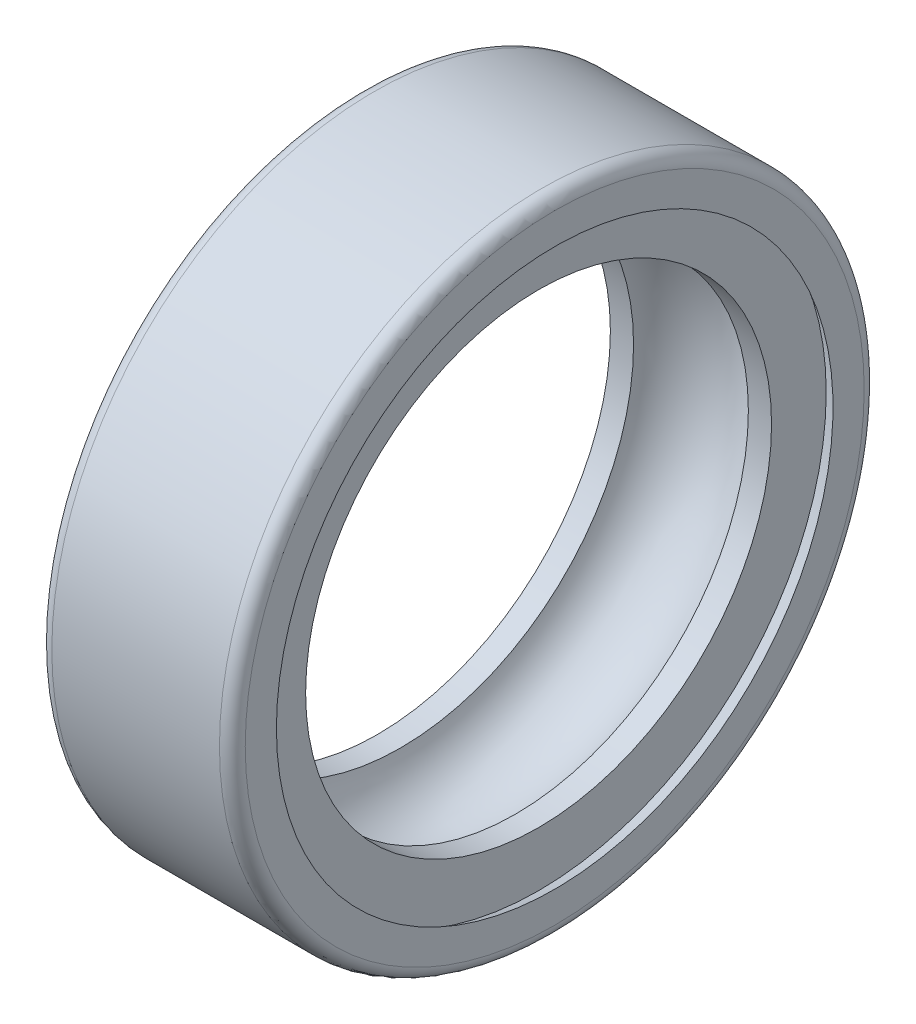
ISO-10303-21;
HEADER;
FILE_DESCRIPTION(('STEP AP214'),'2;1');
FILE_NAME('part.step','',(''),(''),'','','');
FILE_SCHEMA(('AUTOMOTIVE_DESIGN { 1 0 10303 214 1 1 1 1 }'));
ENDSEC;
DATA;
#1=APPLICATION_CONTEXT('core data for automotive mechanical design processes');
#2=APPLICATION_PROTOCOL_DEFINITION('international standard','automotive_design',2000,#1);
#3=PRODUCT_CONTEXT('',#1,'mechanical');
#4=PRODUCT('Part','Part','',(#3));
#5=PRODUCT_RELATED_PRODUCT_CATEGORY('part','',(#4));
#6=PRODUCT_DEFINITION_FORMATION('','',#4);
#7=PRODUCT_DEFINITION_CONTEXT('part definition',#1,'design');
#8=PRODUCT_DEFINITION('design','',#6,#7);
#9=PRODUCT_DEFINITION_SHAPE('','',#8);
#10=(LENGTH_UNIT() NAMED_UNIT(*) SI_UNIT(.MILLI.,.METRE.));
#11=(NAMED_UNIT(*) PLANE_ANGLE_UNIT() SI_UNIT($,.RADIAN.));
#12=(NAMED_UNIT(*) SI_UNIT($,.STERADIAN.) SOLID_ANGLE_UNIT());
#13=UNCERTAINTY_MEASURE_WITH_UNIT(LENGTH_MEASURE(1.E-05),#10,'distance_accuracy_value','');
#14=(GEOMETRIC_REPRESENTATION_CONTEXT(3) GLOBAL_UNCERTAINTY_ASSIGNED_CONTEXT((#13)) GLOBAL_UNIT_ASSIGNED_CONTEXT((#10,
#11,#12)) REPRESENTATION_CONTEXT('',''));
#15=CARTESIAN_POINT('',(0.,0.,0.));
#16=DIRECTION('',(0.,0.,1.));
#17=DIRECTION('',(1.,0.,0.));
#18=AXIS2_PLACEMENT_3D('',#15,#16,#17);
#19=CARTESIAN_POINT('',(0.,0.,0.));
#20=DIRECTION('',(-1.,0.,0.));
#21=DIRECTION('',(0.,0.,1.));
#22=AXIS2_PLACEMENT_3D('',#19,#20,#21);
#23=CYLINDRICAL_SURFACE('',#22,10.84);
#24=CARTESIAN_POINT('',(8.25,0.,0.));
#25=DIRECTION('',(-1.,0.,0.));
#26=DIRECTION('',(0.,0.,1.));
#27=AXIS2_PLACEMENT_3D('',#24,#25,#26);
#28=CIRCLE('',#27,10.84);
#29=CARTESIAN_POINT('',(8.25,0.,10.84));
#30=VERTEX_POINT('',#29);
#31=EDGE_CURVE('E10',#30,#30,#28,.T.);
#32=ORIENTED_EDGE('',*,*,#31,.F.);
#33=EDGE_LOOP('',(#32));
#34=FACE_BOUND('',#33,.T.);
#35=CARTESIAN_POINT('',(7.17102976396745,0.,0.));
#36=DIRECTION('',(-1.,0.,0.));
#37=DIRECTION('',(0.,0.,1.));
#38=AXIS2_PLACEMENT_3D('',#35,#36,#37);
#39=CIRCLE('',#38,10.84);
#40=CARTESIAN_POINT('',(7.17102976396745,0.,10.84));
#41=VERTEX_POINT('',#40);
#42=EDGE_CURVE('E72',#41,#41,#39,.T.);
#43=ORIENTED_EDGE('',*,*,#42,.T.);
#44=EDGE_LOOP('',(#43));
#45=FACE_BOUND('',#44,.T.);
#46=ADVANCED_FACE('F14',(#34,#45),#23,.F.);
#47=CARTESIAN_POINT('',(8.25,10.84,0.));
#48=DIRECTION('',(-1.,0.,0.));
#49=DIRECTION('',(0.,0.,1.));
#50=AXIS2_PLACEMENT_3D('',#47,#48,#49);
#51=PLANE('',#50);
#52=CARTESIAN_POINT('',(8.25,0.,0.));
#53=DIRECTION('',(-1.,0.,0.));
#54=DIRECTION('',(0.,0.,1.));
#55=AXIS2_PLACEMENT_3D('',#52,#53,#54);
#56=CIRCLE('',#55,13.3830127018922);
#57=CARTESIAN_POINT('',(8.25,0.,13.3830127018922));
#58=VERTEX_POINT('',#57);
#59=EDGE_CURVE('E21',#58,#58,#56,.T.);
#60=ORIENTED_EDGE('',*,*,#59,.F.);
#61=EDGE_LOOP('',(#60));
#62=FACE_BOUND('',#61,.T.);
#63=ORIENTED_EDGE('',*,*,#31,.T.);
#64=EDGE_LOOP('',(#63));
#65=FACE_BOUND('',#64,.T.);
#66=ADVANCED_FACE('F91',(#62,#65),#51,.F.);
#67=CARTESIAN_POINT('',(8.25,0.,0.));
#68=DIRECTION('',(-1.,0.,0.));
#69=DIRECTION('',(0.,0.,1.));
#70=AXIS2_PLACEMENT_3D('',#67,#68,#69);
#71=CONICAL_SURFACE('',#70,13.3830127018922,0.523598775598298);
#72=CARTESIAN_POINT('',(9.,0.,0.));
#73=DIRECTION('',(-1.,0.,0.));
#74=DIRECTION('',(0.,0.,1.));
#75=AXIS2_PLACEMENT_3D('',#72,#73,#74);
#76=CIRCLE('',#75,12.95);
#77=CARTESIAN_POINT('',(9.,0.,12.95));
#78=VERTEX_POINT('',#77);
#79=EDGE_CURVE('E30',#78,#78,#76,.T.);
#80=ORIENTED_EDGE('',*,*,#79,.F.);
#81=EDGE_LOOP('',(#80));
#82=FACE_BOUND('',#81,.T.);
#83=ORIENTED_EDGE('',*,*,#59,.T.);
#84=EDGE_LOOP('',(#83));
#85=FACE_BOUND('',#84,.T.);
#86=ADVANCED_FACE('F96',(#82,#85),#71,.F.);
#87=CARTESIAN_POINT('',(9.,12.95,0.));
#88=DIRECTION('',(-1.,0.,0.));
#89=DIRECTION('',(0.,0.,1.));
#90=AXIS2_PLACEMENT_3D('',#87,#88,#89);
#91=PLANE('',#90);
#92=CARTESIAN_POINT('',(9.,0.,0.));
#93=DIRECTION('',(-1.,0.,0.));
#94=DIRECTION('',(0.,0.,1.));
#95=AXIS2_PLACEMENT_3D('',#92,#93,#94);
#96=CIRCLE('',#95,14.4);
#97=CARTESIAN_POINT('',(9.,0.,14.4));
#98=VERTEX_POINT('',#97);
#99=EDGE_CURVE('E38',#98,#98,#96,.T.);
#100=ORIENTED_EDGE('',*,*,#99,.F.);
#101=EDGE_LOOP('',(#100));
#102=FACE_BOUND('',#101,.T.);
#103=ORIENTED_EDGE('',*,*,#79,.T.);
#104=EDGE_LOOP('',(#103));
#105=FACE_BOUND('',#104,.T.);
#106=ADVANCED_FACE('F101',(#102,#105),#91,.F.);
#107=CARTESIAN_POINT('',(8.4,0.,0.));
#108=DIRECTION('',(-1.,0.,0.));
#109=DIRECTION('',(0.,0.,1.));
#110=AXIS2_PLACEMENT_3D('',#107,#108,#109);
#111=TOROIDAL_SURFACE('',#110,14.4,0.6);
#112=CARTESIAN_POINT('',(8.4,0.,0.));
#113=DIRECTION('',(-1.,0.,0.));
#114=DIRECTION('',(0.,0.,1.));
#115=AXIS2_PLACEMENT_3D('',#112,#113,#114);
#116=CIRCLE('',#115,15.);
#117=CARTESIAN_POINT('',(8.4,0.,15.));
#118=VERTEX_POINT('',#117);
#119=EDGE_CURVE('E44',#118,#118,#116,.T.);
#120=ORIENTED_EDGE('',*,*,#119,.F.);
#121=EDGE_LOOP('',(#120));
#122=FACE_BOUND('',#121,.T.);
#123=ORIENTED_EDGE('',*,*,#99,.T.);
#124=EDGE_LOOP('',(#123));
#125=FACE_BOUND('',#124,.T.);
#126=ADVANCED_FACE('F107',(#122,#125),#111,.T.);
#127=CARTESIAN_POINT('',(0.,0.,0.));
#128=DIRECTION('',(-1.,0.,0.));
#129=DIRECTION('',(0.,0.,1.));
#130=AXIS2_PLACEMENT_3D('',#127,#128,#129);
#131=CYLINDRICAL_SURFACE('',#130,15.);
#132=CARTESIAN_POINT('',(0.6,0.,0.));
#133=DIRECTION('',(-1.,0.,0.));
#134=DIRECTION('',(0.,0.,1.));
#135=AXIS2_PLACEMENT_3D('',#132,#133,#134);
#136=CIRCLE('',#135,15.);
#137=CARTESIAN_POINT('',(0.6,0.,15.));
#138=VERTEX_POINT('',#137);
#139=EDGE_CURVE('E48',#138,#138,#136,.T.);
#140=ORIENTED_EDGE('',*,*,#139,.F.);
#141=EDGE_LOOP('',(#140));
#142=FACE_BOUND('',#141,.T.);
#143=ORIENTED_EDGE('',*,*,#119,.T.);
#144=EDGE_LOOP('',(#143));
#145=FACE_BOUND('',#144,.T.);
#146=ADVANCED_FACE('F111',(#142,#145),#131,.T.);
#147=CARTESIAN_POINT('',(0.6,0.,0.));
#148=DIRECTION('',(-1.,0.,0.));
#149=DIRECTION('',(0.,0.,1.));
#150=AXIS2_PLACEMENT_3D('',#147,#148,#149);
#151=TOROIDAL_SURFACE('',#150,14.4,0.6);
#152=CARTESIAN_POINT('',(0.,0.,0.));
#153=DIRECTION('',(-1.,0.,0.));
#154=DIRECTION('',(0.,0.,1.));
#155=AXIS2_PLACEMENT_3D('',#152,#153,#154);
#156=CIRCLE('',#155,14.4);
#157=CARTESIAN_POINT('',(0.,0.,14.4));
#158=VERTEX_POINT('',#157);
#159=EDGE_CURVE('E52',#158,#158,#156,.T.);
#160=ORIENTED_EDGE('',*,*,#159,.F.);
#161=EDGE_LOOP('',(#160));
#162=FACE_BOUND('',#161,.T.);
#163=ORIENTED_EDGE('',*,*,#139,.T.);
#164=EDGE_LOOP('',(#163));
#165=FACE_BOUND('',#164,.T.);
#166=ADVANCED_FACE('F115',(#162,#165),#151,.T.);
#167=CARTESIAN_POINT('',(0.,14.4,0.));
#168=DIRECTION('',(1.,0.,0.));
#169=DIRECTION('',(0.,0.,-1.));
#170=AXIS2_PLACEMENT_3D('',#167,#168,#169);
#171=PLANE('',#170);
#172=CARTESIAN_POINT('',(0.,0.,0.));
#173=DIRECTION('',(-1.,0.,0.));
#174=DIRECTION('',(0.,0.,1.));
#175=AXIS2_PLACEMENT_3D('',#172,#173,#174);
#176=CIRCLE('',#175,12.95);
#177=CARTESIAN_POINT('',(0.,0.,12.95));
#178=VERTEX_POINT('',#177);
#179=EDGE_CURVE('E56',#178,#178,#176,.T.);
#180=ORIENTED_EDGE('',*,*,#179,.F.);
#181=EDGE_LOOP('',(#180));
#182=FACE_BOUND('',#181,.T.);
#183=ORIENTED_EDGE('',*,*,#159,.T.);
#184=EDGE_LOOP('',(#183));
#185=FACE_BOUND('',#184,.T.);
#186=ADVANCED_FACE('F119',(#182,#185),#171,.F.);
#187=CARTESIAN_POINT('',(0.,0.,0.));
#188=DIRECTION('',(1.,0.,0.));
#189=DIRECTION('',(0.,0.,-1.));
#190=AXIS2_PLACEMENT_3D('',#187,#188,#189);
#191=CONICAL_SURFACE('',#190,12.95,0.523598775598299);
#192=CARTESIAN_POINT('',(0.75,0.,0.));
#193=DIRECTION('',(-1.,0.,0.));
#194=DIRECTION('',(0.,0.,1.));
#195=AXIS2_PLACEMENT_3D('',#192,#193,#194);
#196=CIRCLE('',#195,13.3830127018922);
#197=CARTESIAN_POINT('',(0.75,0.,13.3830127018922));
#198=VERTEX_POINT('',#197);
#199=EDGE_CURVE('E60',#198,#198,#196,.T.);
#200=ORIENTED_EDGE('',*,*,#199,.F.);
#201=EDGE_LOOP('',(#200));
#202=FACE_BOUND('',#201,.T.);
#203=ORIENTED_EDGE('',*,*,#179,.T.);
#204=EDGE_LOOP('',(#203));
#205=FACE_BOUND('',#204,.T.);
#206=ADVANCED_FACE('F123',(#202,#205),#191,.F.);
#207=CARTESIAN_POINT('',(0.75,13.3830127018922,0.));
#208=DIRECTION('',(1.,0.,0.));
#209=DIRECTION('',(0.,0.,-1.));
#210=AXIS2_PLACEMENT_3D('',#207,#208,#209);
#211=PLANE('',#210);
#212=CARTESIAN_POINT('',(0.75,0.,0.));
#213=DIRECTION('',(-1.,0.,0.));
#214=DIRECTION('',(0.,0.,1.));
#215=AXIS2_PLACEMENT_3D('',#212,#213,#214);
#216=CIRCLE('',#215,10.84);
#217=CARTESIAN_POINT('',(0.75,0.,10.84));
#218=VERTEX_POINT('',#217);
#219=EDGE_CURVE('E64',#218,#218,#216,.T.);
#220=ORIENTED_EDGE('',*,*,#219,.F.);
#221=EDGE_LOOP('',(#220));
#222=FACE_BOUND('',#221,.T.);
#223=ORIENTED_EDGE('',*,*,#199,.T.);
#224=EDGE_LOOP('',(#223));
#225=FACE_BOUND('',#224,.T.);
#226=ADVANCED_FACE('F87',(#222,#225),#211,.F.);
#227=CARTESIAN_POINT('',(0.,0.,0.));
#228=DIRECTION('',(-1.,0.,0.));
#229=DIRECTION('',(0.,0.,1.));
#230=AXIS2_PLACEMENT_3D('',#227,#228,#229);
#231=CYLINDRICAL_SURFACE('',#230,10.84);
#232=CARTESIAN_POINT('',(1.82897023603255,0.,0.));
#233=DIRECTION('',(-1.,0.,0.));
#234=DIRECTION('',(0.,0.,1.));
#235=AXIS2_PLACEMENT_3D('',#232,#233,#234);
#236=CIRCLE('',#235,10.84);
#237=CARTESIAN_POINT('',(1.82897023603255,0.,10.84));
#238=VERTEX_POINT('',#237);
#239=EDGE_CURVE('E68',#238,#238,#236,.T.);
#240=ORIENTED_EDGE('',*,*,#239,.F.);
#241=EDGE_LOOP('',(#240));
#242=FACE_BOUND('',#241,.T.);
#243=ORIENTED_EDGE('',*,*,#219,.T.);
#244=EDGE_LOOP('',(#243));
#245=FACE_BOUND('',#244,.T.);
#246=ADVANCED_FACE('F80',(#242,#245),#231,.F.);
#247=CARTESIAN_POINT('',(4.5,0.,0.));
#248=DIRECTION('',(-1.,0.,0.));
#249=DIRECTION('',(0.,0.,1.));
#250=AXIS2_PLACEMENT_3D('',#247,#248,#249);
#251=TOROIDAL_SURFACE('',#250,10.,2.8);
#252=ORIENTED_EDGE('',*,*,#239,.T.);
#253=EDGE_LOOP('',(#252));
#254=FACE_BOUND('',#253,.T.);
#255=ORIENTED_EDGE('',*,*,#42,.F.);
#256=EDGE_LOOP('',(#255));
#257=FACE_BOUND('',#256,.T.);
#258=ADVANCED_FACE('F78',(#254,#257),#251,.F.);
#259=CLOSED_SHELL('',(#46,#66,#86,#106,#126,#146,#166,#186,#206,#226,#246,#258));
#260=MANIFOLD_SOLID_BREP('B1',#259);
#261=ADVANCED_BREP_SHAPE_REPRESENTATION('',(#18,#260),#14);
#262=SHAPE_DEFINITION_REPRESENTATION(#9,#261);
ENDSEC;
END-ISO-10303-21;
